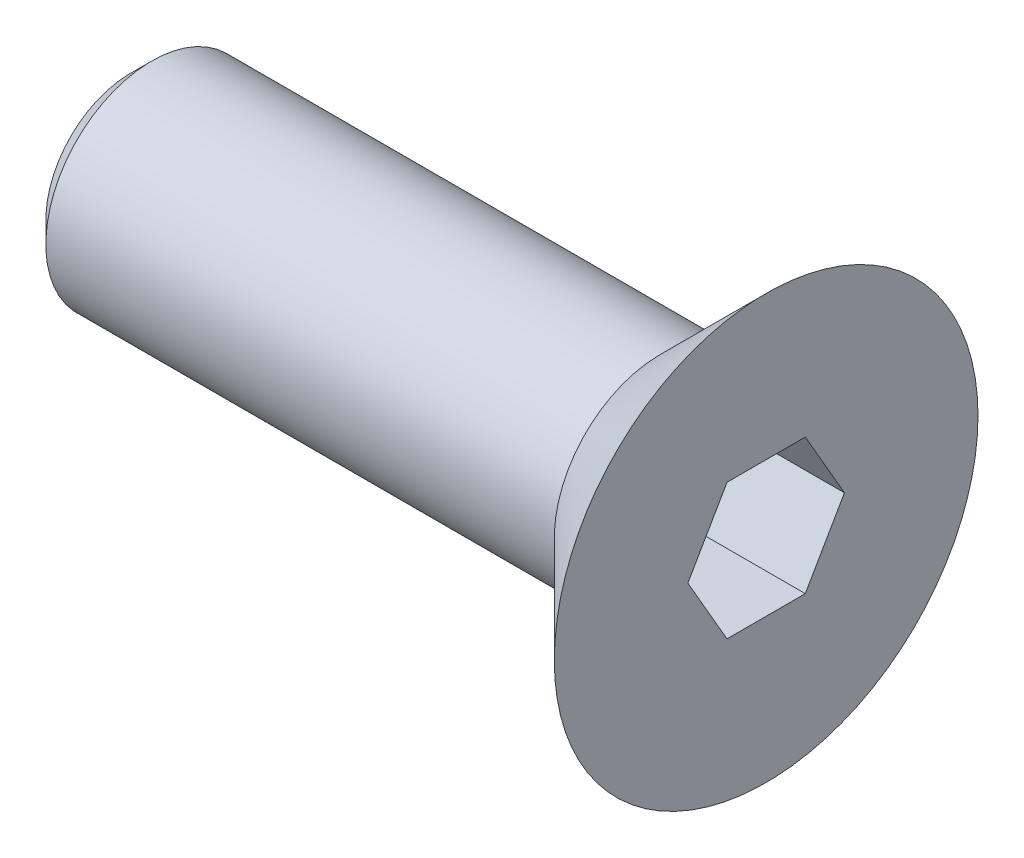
ISO-10303-21;
HEADER;
FILE_DESCRIPTION(('STEP AP214'),'2;1');
FILE_NAME('part.step','',(''),(''),'','','');
FILE_SCHEMA(('AUTOMOTIVE_DESIGN { 1 0 10303 214 1 1 1 1 }'));
ENDSEC;
DATA;
#1=APPLICATION_CONTEXT('core data for automotive mechanical design processes');
#2=APPLICATION_PROTOCOL_DEFINITION('international standard','automotive_design',2000,#1);
#3=PRODUCT_CONTEXT('',#1,'mechanical');
#4=PRODUCT('Part','Part','',(#3));
#5=PRODUCT_RELATED_PRODUCT_CATEGORY('part','',(#4));
#6=PRODUCT_DEFINITION_FORMATION('','',#4);
#7=PRODUCT_DEFINITION_CONTEXT('part definition',#1,'design');
#8=PRODUCT_DEFINITION('design','',#6,#7);
#9=PRODUCT_DEFINITION_SHAPE('','',#8);
#10=(LENGTH_UNIT() NAMED_UNIT(*) SI_UNIT(.MILLI.,.METRE.));
#11=(NAMED_UNIT(*) PLANE_ANGLE_UNIT() SI_UNIT($,.RADIAN.));
#12=(NAMED_UNIT(*) SI_UNIT($,.STERADIAN.) SOLID_ANGLE_UNIT());
#13=UNCERTAINTY_MEASURE_WITH_UNIT(LENGTH_MEASURE(1.E-05),#10,'distance_accuracy_value','');
#14=(GEOMETRIC_REPRESENTATION_CONTEXT(3) GLOBAL_UNCERTAINTY_ASSIGNED_CONTEXT((#13)) GLOBAL_UNIT_ASSIGNED_CONTEXT((#10,
#11,#12)) REPRESENTATION_CONTEXT('',''));
#15=CARTESIAN_POINT('',(0.,0.,0.));
#16=DIRECTION('',(0.,0.,1.));
#17=DIRECTION('',(1.,0.,0.));
#18=AXIS2_PLACEMENT_3D('',#15,#16,#17);
#19=CARTESIAN_POINT('',(-2.5,0.,0.));
#20=DIRECTION('',(1.,0.,0.));
#21=DIRECTION('',(0.,0.,-1.));
#22=AXIS2_PLACEMENT_3D('',#19,#20,#21);
#23=PLANE('',#22);
#24=DIRECTION('',(0.,0.866025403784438,0.5));
#25=VECTOR('',#24,1.);
#26=CARTESIAN_POINT('',(-2.5,0.,-1.8475208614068));
#27=LINE('',#26,#25);
#28=CARTESIAN_POINT('',(-2.5,0.,-1.8475208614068));
#29=VERTEX_POINT('',#28);
#30=CARTESIAN_POINT('',(-2.5,1.6,-0.9237604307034));
#31=VERTEX_POINT('',#30);
#32=EDGE_CURVE('E72',#29,#31,#27,.T.);
#33=ORIENTED_EDGE('',*,*,#32,.T.);
#34=DIRECTION('',(0.,0.,1.));
#35=VECTOR('',#34,1.);
#36=CARTESIAN_POINT('',(-2.5,1.6,0.));
#37=LINE('',#36,#35);
#38=CARTESIAN_POINT('',(-2.5,1.6,0.9237604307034));
#39=VERTEX_POINT('',#38);
#40=EDGE_CURVE('E121',#31,#39,#37,.T.);
#41=ORIENTED_EDGE('',*,*,#40,.T.);
#42=DIRECTION('',(0.,-0.866025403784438,0.5));
#43=VECTOR('',#42,1.);
#44=CARTESIAN_POINT('',(-2.5,1.6,0.9237604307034));
#45=LINE('',#44,#43);
#46=CARTESIAN_POINT('',(-2.5,0.,1.8475208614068));
#47=VERTEX_POINT('',#46);
#48=EDGE_CURVE('E126',#39,#47,#45,.T.);
#49=ORIENTED_EDGE('',*,*,#48,.T.);
#50=DIRECTION('',(0.,-0.866025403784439,-0.5));
#51=VECTOR('',#50,1.);
#52=CARTESIAN_POINT('',(-2.5,0.,1.8475208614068));
#53=LINE('',#52,#51);
#54=CARTESIAN_POINT('',(-2.5,-1.6,0.923760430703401));
#55=VERTEX_POINT('',#54);
#56=EDGE_CURVE('E130',#47,#55,#53,.T.);
#57=ORIENTED_EDGE('',*,*,#56,.T.);
#58=DIRECTION('',(0.,0.,-1.));
#59=VECTOR('',#58,1.);
#60=CARTESIAN_POINT('',(-2.5,-1.6,0.923760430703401));
#61=LINE('',#60,#59);
#62=CARTESIAN_POINT('',(-2.5,-1.6,-0.923760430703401));
#63=VERTEX_POINT('',#62);
#64=EDGE_CURVE('E68',#55,#63,#61,.T.);
#65=ORIENTED_EDGE('',*,*,#64,.T.);
#66=DIRECTION('',(0.,0.866025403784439,-0.5));
#67=VECTOR('',#66,1.);
#68=CARTESIAN_POINT('',(-2.5,-1.6,-0.923760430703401));
#69=LINE('',#68,#67);
#70=EDGE_CURVE('E70',#63,#29,#69,.T.);
#71=ORIENTED_EDGE('',*,*,#70,.T.);
#72=EDGE_LOOP('',(#33,#41,#49,#57,#65,#71));
#73=FACE_BOUND('',#72,.T.);
#74=ADVANCED_FACE('F17',(#73),#23,.T.);
#75=CARTESIAN_POINT('',(0.,0.,-1.8475208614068));
#76=DIRECTION('',(0.,0.5,-0.866025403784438));
#77=DIRECTION('',(0.,0.866025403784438,0.5));
#78=AXIS2_PLACEMENT_3D('',#75,#76,#77);
#79=PLANE('',#78);
#80=ORIENTED_EDGE('',*,*,#32,.F.);
#81=DIRECTION('',(1.,0.,0.));
#82=VECTOR('',#81,1.);
#83=CARTESIAN_POINT('',(0.,0.,-1.8475208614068));
#84=LINE('',#83,#82);
#85=CARTESIAN_POINT('',(0.,0.,-1.8475208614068));
#86=VERTEX_POINT('',#85);
#87=EDGE_CURVE('E77',#29,#86,#84,.T.);
#88=ORIENTED_EDGE('',*,*,#87,.T.);
#89=DIRECTION('',(0.,-0.866025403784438,-0.5));
#90=VECTOR('',#89,1.);
#91=CARTESIAN_POINT('',(0.,1.6,-0.9237604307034));
#92=LINE('',#91,#90);
#93=CARTESIAN_POINT('',(0.,1.6,-0.9237604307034));
#94=VERTEX_POINT('',#93);
#95=EDGE_CURVE('E118',#94,#86,#92,.T.);
#96=ORIENTED_EDGE('',*,*,#95,.F.);
#97=DIRECTION('',(1.,0.,0.));
#98=VECTOR('',#97,1.);
#99=CARTESIAN_POINT('',(0.,1.6,-0.9237604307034));
#100=LINE('',#99,#98);
#101=EDGE_CURVE('E83',#94,#31,#100,.F.);
#102=ORIENTED_EDGE('',*,*,#101,.T.);
#103=EDGE_LOOP('',(#80,#88,#96,#102));
#104=FACE_BOUND('',#103,.T.);
#105=ADVANCED_FACE('F80',(#104),#79,.F.);
#106=CARTESIAN_POINT('',(0.,-1.6,-0.923760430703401));
#107=DIRECTION('',(0.,-0.5,-0.866025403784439));
#108=DIRECTION('',(0.,0.866025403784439,-0.5));
#109=AXIS2_PLACEMENT_3D('',#106,#107,#108);
#110=PLANE('',#109);
#111=ORIENTED_EDGE('',*,*,#70,.F.);
#112=DIRECTION('',(1.,0.,0.));
#113=VECTOR('',#112,1.);
#114=CARTESIAN_POINT('',(0.,-1.6,-0.923760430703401));
#115=LINE('',#114,#113);
#116=CARTESIAN_POINT('',(0.,-1.6,-0.923760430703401));
#117=VERTEX_POINT('',#116);
#118=EDGE_CURVE('E91',#63,#117,#115,.T.);
#119=ORIENTED_EDGE('',*,*,#118,.T.);
#120=DIRECTION('',(0.,-0.866025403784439,0.5));
#121=VECTOR('',#120,1.);
#122=CARTESIAN_POINT('',(0.,0.,-1.8475208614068));
#123=LINE('',#122,#121);
#124=EDGE_CURVE('E88',#86,#117,#123,.T.);
#125=ORIENTED_EDGE('',*,*,#124,.F.);
#126=ORIENTED_EDGE('',*,*,#87,.F.);
#127=EDGE_LOOP('',(#111,#119,#125,#126));
#128=FACE_BOUND('',#127,.T.);
#129=ADVANCED_FACE('F86',(#128),#110,.F.);
#130=CARTESIAN_POINT('',(0.,-1.6,0.923760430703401));
#131=DIRECTION('',(0.,-1.,0.));
#132=DIRECTION('',(0.,0.,-1.));
#133=AXIS2_PLACEMENT_3D('',#130,#131,#132);
#134=PLANE('',#133);
#135=ORIENTED_EDGE('',*,*,#64,.F.);
#136=DIRECTION('',(1.,0.,0.));
#137=VECTOR('',#136,1.);
#138=CARTESIAN_POINT('',(0.,-1.6,0.923760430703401));
#139=LINE('',#138,#137);
#140=CARTESIAN_POINT('',(0.,-1.6,0.923760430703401));
#141=VERTEX_POINT('',#140);
#142=EDGE_CURVE('E128',#55,#141,#139,.T.);
#143=ORIENTED_EDGE('',*,*,#142,.T.);
#144=DIRECTION('',(0.,0.,-1.));
#145=VECTOR('',#144,1.);
#146=CARTESIAN_POINT('',(0.,-1.6,0.));
#147=LINE('',#146,#145);
#148=EDGE_CURVE('E114',#117,#141,#147,.F.);
#149=ORIENTED_EDGE('',*,*,#148,.F.);
#150=ORIENTED_EDGE('',*,*,#118,.F.);
#151=EDGE_LOOP('',(#135,#143,#149,#150));
#152=FACE_BOUND('',#151,.T.);
#153=ADVANCED_FACE('F133',(#152),#134,.F.);
#154=CARTESIAN_POINT('',(0.,0.,1.8475208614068));
#155=DIRECTION('',(0.,-0.5,0.866025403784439));
#156=DIRECTION('',(0.,-0.866025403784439,-0.5));
#157=AXIS2_PLACEMENT_3D('',#154,#155,#156);
#158=PLANE('',#157);
#159=ORIENTED_EDGE('',*,*,#56,.F.);
#160=DIRECTION('',(1.,0.,0.));
#161=VECTOR('',#160,1.);
#162=CARTESIAN_POINT('',(0.,0.,1.8475208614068));
#163=LINE('',#162,#161);
#164=CARTESIAN_POINT('',(0.,0.,1.8475208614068));
#165=VERTEX_POINT('',#164);
#166=EDGE_CURVE('E124',#47,#165,#163,.T.);
#167=ORIENTED_EDGE('',*,*,#166,.T.);
#168=DIRECTION('',(0.,0.866025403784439,0.5));
#169=VECTOR('',#168,1.);
#170=CARTESIAN_POINT('',(0.,-1.6,0.923760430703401));
#171=LINE('',#170,#169);
#172=EDGE_CURVE('E109',#141,#165,#171,.T.);
#173=ORIENTED_EDGE('',*,*,#172,.F.);
#174=ORIENTED_EDGE('',*,*,#142,.F.);
#175=EDGE_LOOP('',(#159,#167,#173,#174));
#176=FACE_BOUND('',#175,.T.);
#177=ADVANCED_FACE('F144',(#176),#158,.F.);
#178=CARTESIAN_POINT('',(0.,1.6,0.9237604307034));
#179=DIRECTION('',(0.,0.5,0.866025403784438));
#180=DIRECTION('',(0.,-0.866025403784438,0.5));
#181=AXIS2_PLACEMENT_3D('',#178,#179,#180);
#182=PLANE('',#181);
#183=ORIENTED_EDGE('',*,*,#48,.F.);
#184=DIRECTION('',(1.,0.,0.));
#185=VECTOR('',#184,1.);
#186=CARTESIAN_POINT('',(0.,1.6,0.9237604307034));
#187=LINE('',#186,#185);
#188=CARTESIAN_POINT('',(0.,1.6,0.9237604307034));
#189=VERTEX_POINT('',#188);
#190=EDGE_CURVE('E35',#39,#189,#187,.T.);
#191=ORIENTED_EDGE('',*,*,#190,.T.);
#192=DIRECTION('',(0.,0.866025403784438,-0.500000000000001));
#193=VECTOR('',#192,1.);
#194=CARTESIAN_POINT('',(0.,0.,1.8475208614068));
#195=LINE('',#194,#193);
#196=EDGE_CURVE('E105',#165,#189,#195,.T.);
#197=ORIENTED_EDGE('',*,*,#196,.F.);
#198=ORIENTED_EDGE('',*,*,#166,.F.);
#199=EDGE_LOOP('',(#183,#191,#197,#198));
#200=FACE_BOUND('',#199,.T.);
#201=ADVANCED_FACE('F142',(#200),#182,.F.);
#202=CARTESIAN_POINT('',(0.,1.6,0.));
#203=DIRECTION('',(0.,1.,0.));
#204=DIRECTION('',(0.,0.,1.));
#205=AXIS2_PLACEMENT_3D('',#202,#203,#204);
#206=PLANE('',#205);
#207=ORIENTED_EDGE('',*,*,#40,.F.);
#208=ORIENTED_EDGE('',*,*,#101,.F.);
#209=DIRECTION('',(0.,0.,-1.));
#210=VECTOR('',#209,1.);
#211=CARTESIAN_POINT('',(0.,1.6,0.));
#212=LINE('',#211,#210);
#213=EDGE_CURVE('E101',#189,#94,#212,.T.);
#214=ORIENTED_EDGE('',*,*,#213,.F.);
#215=ORIENTED_EDGE('',*,*,#190,.F.);
#216=EDGE_LOOP('',(#207,#208,#214,#215));
#217=FACE_BOUND('',#216,.T.);
#218=ADVANCED_FACE('F139',(#217),#206,.F.);
#219=CARTESIAN_POINT('',(-15.,0.,0.));
#220=DIRECTION('',(1.,0.,0.));
#221=DIRECTION('',(0.,0.,-1.));
#222=AXIS2_PLACEMENT_3D('',#219,#220,#221);
#223=PLANE('',#222);
#224=CARTESIAN_POINT('',(-14.9999999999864,0.,0.));
#225=DIRECTION('',(1.,0.,0.));
#226=DIRECTION('',(0.,0.,-1.));
#227=AXIS2_PLACEMENT_3D('',#224,#225,#226);
#228=CIRCLE('',#227,2.00000000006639);
#229=CARTESIAN_POINT('',(-14.9999999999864,0.,-2.00000000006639));
#230=VERTEX_POINT('',#229);
#231=EDGE_CURVE('E20',#230,#230,#228,.T.);
#232=ORIENTED_EDGE('',*,*,#231,.F.);
#233=EDGE_LOOP('',(#232));
#234=FACE_BOUND('',#233,.T.);
#235=ADVANCED_FACE('F171',(#234),#223,.F.);
#236=CARTESIAN_POINT('',(0.,0.,0.));
#237=DIRECTION('',(1.,0.,0.));
#238=DIRECTION('',(0.,0.,-1.));
#239=AXIS2_PLACEMENT_3D('',#236,#237,#238);
#240=PLANE('',#239);
#241=ORIENTED_EDGE('',*,*,#196,.T.);
#242=ORIENTED_EDGE('',*,*,#213,.T.);
#243=ORIENTED_EDGE('',*,*,#95,.T.);
#244=ORIENTED_EDGE('',*,*,#124,.T.);
#245=ORIENTED_EDGE('',*,*,#148,.T.);
#246=ORIENTED_EDGE('',*,*,#172,.T.);
#247=EDGE_LOOP('',(#241,#242,#243,#244,#245,#246));
#248=FACE_BOUND('',#247,.T.);
#249=CARTESIAN_POINT('',(0.,0.,0.));
#250=DIRECTION('',(1.,0.,0.));
#251=DIRECTION('',(0.,0.,-1.));
#252=AXIS2_PLACEMENT_3D('',#249,#250,#251);
#253=CIRCLE('',#252,4.99999999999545);
#254=CARTESIAN_POINT('',(0.,0.,-4.99999999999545));
#255=VERTEX_POINT('',#254);
#256=EDGE_CURVE('E94',#255,#255,#253,.F.);
#257=ORIENTED_EDGE('',*,*,#256,.F.);
#258=EDGE_LOOP('',(#257));
#259=FACE_BOUND('',#258,.T.);
#260=ADVANCED_FACE('F136',(#248,#259),#240,.T.);
#261=CARTESIAN_POINT('',(-14.4999999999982,0.,0.));
#262=DIRECTION('',(1.,0.,0.));
#263=DIRECTION('',(0.,0.,-1.));
#264=AXIS2_PLACEMENT_3D('',#261,#262,#263);
#265=CONICAL_SURFACE('',#264,2.50000000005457,0.785398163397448);
#266=CARTESIAN_POINT('',(-14.5,0.,0.));
#267=DIRECTION('',(1.,0.,0.));
#268=DIRECTION('',(0.,0.,-1.));
#269=AXIS2_PLACEMENT_3D('',#266,#267,#268);
#270=CIRCLE('',#269,2.5);
#271=CARTESIAN_POINT('',(-14.5,0.,-2.5));
#272=VERTEX_POINT('',#271);
#273=EDGE_CURVE('E26',#272,#272,#270,.T.);
#274=ORIENTED_EDGE('',*,*,#273,.F.);
#275=EDGE_LOOP('',(#274));
#276=FACE_BOUND('',#275,.T.);
#277=ORIENTED_EDGE('',*,*,#231,.T.);
#278=EDGE_LOOP('',(#277));
#279=FACE_BOUND('',#278,.T.);
#280=ADVANCED_FACE('F162',(#276,#279),#265,.T.);
#281=CARTESIAN_POINT('',(0.,0.,0.));
#282=DIRECTION('',(1.,0.,0.));
#283=DIRECTION('',(0.,0.,-1.));
#284=AXIS2_PLACEMENT_3D('',#281,#282,#283);
#285=CONICAL_SURFACE('',#284,4.99999999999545,0.785398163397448);
#286=ORIENTED_EDGE('',*,*,#256,.T.);
#287=EDGE_LOOP('',(#286));
#288=FACE_BOUND('',#287,.T.);
#289=CARTESIAN_POINT('',(-2.50000000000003,0.,0.));
#290=DIRECTION('',(1.,0.,0.));
#291=DIRECTION('',(0.,0.,-1.));
#292=AXIS2_PLACEMENT_3D('',#289,#290,#291);
#293=CIRCLE('',#292,2.5);
#294=CARTESIAN_POINT('',(-2.50000000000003,0.,-2.5));
#295=VERTEX_POINT('',#294);
#296=EDGE_CURVE('E11',#295,#295,#293,.F.);
#297=ORIENTED_EDGE('',*,*,#296,.F.);
#298=EDGE_LOOP('',(#297));
#299=FACE_BOUND('',#298,.T.);
#300=ADVANCED_FACE('F156',(#288,#299),#285,.T.);
#301=CARTESIAN_POINT('',(-15.75,0.,0.));
#302=DIRECTION('',(1.,0.,0.));
#303=DIRECTION('',(0.,0.,-1.));
#304=AXIS2_PLACEMENT_3D('',#301,#302,#303);
#305=CYLINDRICAL_SURFACE('',#304,2.5);
#306=ORIENTED_EDGE('',*,*,#296,.T.);
#307=EDGE_LOOP('',(#306));
#308=FACE_BOUND('',#307,.T.);
#309=ORIENTED_EDGE('',*,*,#273,.T.);
#310=EDGE_LOOP('',(#309));
#311=FACE_BOUND('',#310,.T.);
#312=ADVANCED_FACE('F154',(#308,#311),#305,.T.);
#313=CLOSED_SHELL('',(#74,#105,#129,#153,#177,#201,#218,#235,#260,#280,#300,#312));
#314=MANIFOLD_SOLID_BREP('B1',#313);
#315=ADVANCED_BREP_SHAPE_REPRESENTATION('',(#18,#314),#14);
#316=SHAPE_DEFINITION_REPRESENTATION(#9,#315);
ENDSEC;
END-ISO-10303-21;
